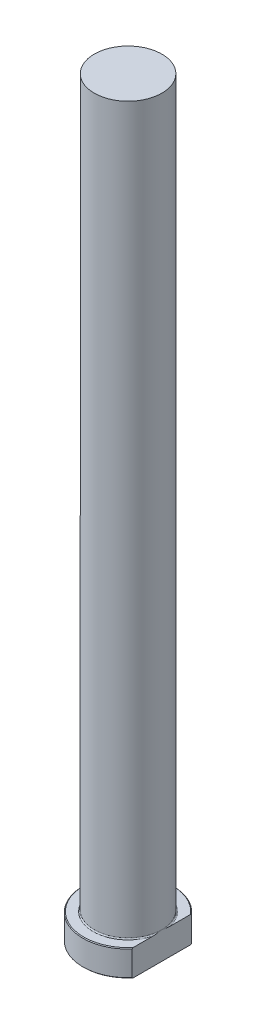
from build123d import *
from build123d.topology import SkipClean

# Parameters (mm, degrees)
CHAMFER1_SIZE = 0.2
FILLET1_R     = 0.3
KEY_DEPTH     = 201.718708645


with BuildPart() as part:
    # Sketch1 → Revolve1 (revolve)
    with BuildSketch(Plane.XY, mode=Mode.PRIVATE) as revolve1_sk:
        Polygon((0, 0), (-12, 0), (-12, 7), (-9, 7), (-9, 200), (0, 200), align=None)
    revolve(revolve1_sk.sketch.rotate(Axis((0, 259.958771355, 0), (0, -1, 0)), 270), axis=Axis((0, 259.958771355, 0), (0, -1, 0)))

    # Chamfer1
    chamfer1_edges = [part.edges().sort_by_distance(p)[0] for p in [
        (0, 7, -12),
        (0, 0, -12),
    ]]
    chamfer(chamfer1_edges, length=CHAMFER1_SIZE)

    # Fillet1
    fillet1_edges = [part.edges().sort_by_distance(p)[0] for p in [
        (0, 7, -9),
    ]]
    fillet(fillet1_edges, radius=FILLET1_R)

    # Sketch2 → KEY (cut, through all)
    with SkipClean():  # the faces are left unmerged after this step: merging them gives an invalid solid
        with BuildSketch(Plane(origin=(0, 0, 0), x_dir=(1, 0, 0), z_dir=(0, 1, 0))):
            with BuildLine():
                Line((9, 7.937253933), (9, -7.937253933))
                ThreePointArc((9, -7.937253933), (12, 0), (9, 7.937253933))
            make_face()
        extrude(amount=KEY_DEPTH, mode=Mode.SUBTRACT)


solid = part.part
